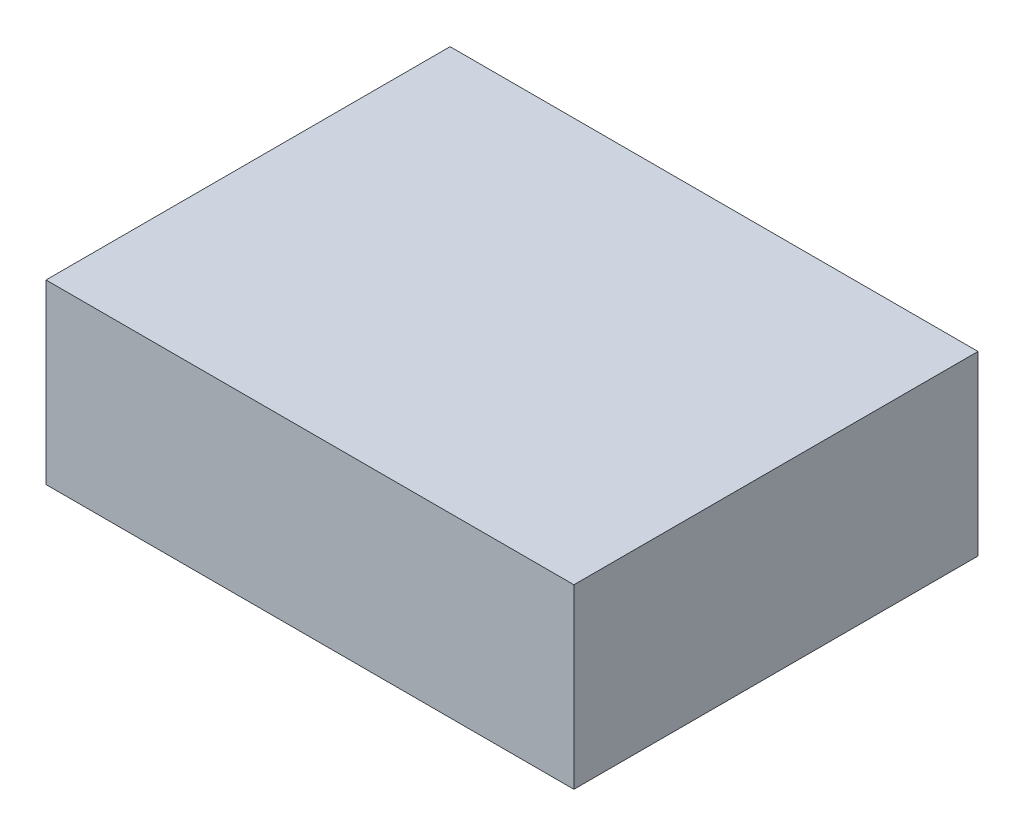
ISO-10303-21;
HEADER;
FILE_DESCRIPTION(('STEP AP214'),'2;1');
FILE_NAME('part.step','',(''),(''),'','','');
FILE_SCHEMA(('AUTOMOTIVE_DESIGN { 1 0 10303 214 1 1 1 1 }'));
ENDSEC;
DATA;
#1=APPLICATION_CONTEXT('core data for automotive mechanical design processes');
#2=APPLICATION_PROTOCOL_DEFINITION('international standard','automotive_design',2000,#1);
#3=PRODUCT_CONTEXT('',#1,'mechanical');
#4=PRODUCT('Part','Part','',(#3));
#5=PRODUCT_RELATED_PRODUCT_CATEGORY('part','',(#4));
#6=PRODUCT_DEFINITION_FORMATION('','',#4);
#7=PRODUCT_DEFINITION_CONTEXT('part definition',#1,'design');
#8=PRODUCT_DEFINITION('design','',#6,#7);
#9=PRODUCT_DEFINITION_SHAPE('','',#8);
#10=(LENGTH_UNIT() NAMED_UNIT(*) SI_UNIT(.MILLI.,.METRE.));
#11=(NAMED_UNIT(*) PLANE_ANGLE_UNIT() SI_UNIT($,.RADIAN.));
#12=(NAMED_UNIT(*) SI_UNIT($,.STERADIAN.) SOLID_ANGLE_UNIT());
#13=UNCERTAINTY_MEASURE_WITH_UNIT(LENGTH_MEASURE(1.E-05),#10,'distance_accuracy_value','');
#14=(GEOMETRIC_REPRESENTATION_CONTEXT(3) GLOBAL_UNCERTAINTY_ASSIGNED_CONTEXT((#13)) GLOBAL_UNIT_ASSIGNED_CONTEXT((#10,
#11,#12)) REPRESENTATION_CONTEXT('',''));
#15=CARTESIAN_POINT('',(0.,0.,0.));
#16=DIRECTION('',(0.,0.,1.));
#17=DIRECTION('',(1.,0.,0.));
#18=AXIS2_PLACEMENT_3D('',#15,#16,#17);
#19=CARTESIAN_POINT('',(1.270000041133E-06,0.,0.22999954));
#20=DIRECTION('',(0.,0.,-1.));
#21=DIRECTION('',(0.,-1.,0.));
#22=AXIS2_PLACEMENT_3D('',#19,#20,#21);
#23=PLANE('',#22);
#24=DIRECTION('',(1.,0.,0.));
#25=VECTOR('',#24,1.);
#26=CARTESIAN_POINT('',(-0.150241,0.05042408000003,0.22999954));
#27=LINE('',#26,#25);
#28=CARTESIAN_POINT('',(-0.150241,0.05042408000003,0.22999954));
#29=VERTEX_POINT('',#28);
#30=CARTESIAN_POINT('',(0.15024354,0.05042408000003,0.22999954));
#31=VERTEX_POINT('',#30);
#32=EDGE_CURVE('E25',#29,#31,#27,.T.);
#33=ORIENTED_EDGE('',*,*,#32,.F.);
#34=DIRECTION('',(0.,1.,0.));
#35=VECTOR('',#34,1.);
#36=CARTESIAN_POINT('',(-0.150241,-0.05042407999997,0.22999954));
#37=LINE('',#36,#35);
#38=CARTESIAN_POINT('',(-0.150241,-0.05042407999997,0.22999954));
#39=VERTEX_POINT('',#38);
#40=EDGE_CURVE('E107',#39,#29,#37,.T.);
#41=ORIENTED_EDGE('',*,*,#40,.F.);
#42=DIRECTION('',(-1.,0.,0.));
#43=VECTOR('',#42,1.);
#44=CARTESIAN_POINT('',(0.15024354,-0.05042407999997,0.22999954));
#45=LINE('',#44,#43);
#46=CARTESIAN_POINT('',(0.15024354,-0.05042407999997,0.22999954));
#47=VERTEX_POINT('',#46);
#48=EDGE_CURVE('E83',#47,#39,#45,.T.);
#49=ORIENTED_EDGE('',*,*,#48,.F.);
#50=DIRECTION('',(0.,-1.,0.));
#51=VECTOR('',#50,1.);
#52=CARTESIAN_POINT('',(0.15024354,0.05042408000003,0.22999954));
#53=LINE('',#52,#51);
#54=EDGE_CURVE('E87',#31,#47,#53,.T.);
#55=ORIENTED_EDGE('',*,*,#54,.F.);
#56=EDGE_LOOP('',(#33,#41,#49,#55));
#57=FACE_BOUND('',#56,.T.);
#58=ADVANCED_FACE('F17',(#57),#23,.F.);
#59=CARTESIAN_POINT('',(1.270000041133E-06,0.,0.));
#60=DIRECTION('',(0.,0.,-1.));
#61=DIRECTION('',(0.,-1.,0.));
#62=AXIS2_PLACEMENT_3D('',#59,#60,#61);
#63=PLANE('',#62);
#64=DIRECTION('',(0.,-1.,0.));
#65=VECTOR('',#64,1.);
#66=CARTESIAN_POINT('',(0.15024354,0.05042408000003,0.));
#67=LINE('',#66,#65);
#68=CARTESIAN_POINT('',(0.15024354,0.05042408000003,0.));
#69=VERTEX_POINT('',#68);
#70=CARTESIAN_POINT('',(0.15024354,-0.05042407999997,0.));
#71=VERTEX_POINT('',#70);
#72=EDGE_CURVE('E71',#69,#71,#67,.T.);
#73=ORIENTED_EDGE('',*,*,#72,.T.);
#74=DIRECTION('',(-1.,0.,0.));
#75=VECTOR('',#74,1.);
#76=CARTESIAN_POINT('',(0.15024354,-0.05042407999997,0.));
#77=LINE('',#76,#75);
#78=CARTESIAN_POINT('',(-0.150241,-0.05042407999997,0.));
#79=VERTEX_POINT('',#78);
#80=EDGE_CURVE('E104',#71,#79,#77,.T.);
#81=ORIENTED_EDGE('',*,*,#80,.T.);
#82=DIRECTION('',(0.,1.,0.));
#83=VECTOR('',#82,1.);
#84=CARTESIAN_POINT('',(-0.150241,-0.05042407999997,0.));
#85=LINE('',#84,#83);
#86=CARTESIAN_POINT('',(-0.150241,0.05042408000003,0.));
#87=VERTEX_POINT('',#86);
#88=EDGE_CURVE('E73',#79,#87,#85,.T.);
#89=ORIENTED_EDGE('',*,*,#88,.T.);
#90=DIRECTION('',(1.,0.,0.));
#91=VECTOR('',#90,1.);
#92=CARTESIAN_POINT('',(-0.150241,0.05042408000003,0.));
#93=LINE('',#92,#91);
#94=EDGE_CURVE('E11',#87,#69,#93,.T.);
#95=ORIENTED_EDGE('',*,*,#94,.T.);
#96=EDGE_LOOP('',(#73,#81,#89,#95));
#97=FACE_BOUND('',#96,.T.);
#98=ADVANCED_FACE('F69',(#97),#63,.T.);
#99=CARTESIAN_POINT('',(-0.150241,0.05042408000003,0.));
#100=DIRECTION('',(0.,1.,0.));
#101=DIRECTION('',(1.,0.,0.));
#102=AXIS2_PLACEMENT_3D('',#99,#100,#101);
#103=PLANE('',#102);
#104=DIRECTION('',(0.,0.,1.));
#105=VECTOR('',#104,1.);
#106=CARTESIAN_POINT('',(-0.150241,0.05042408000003,0.));
#107=LINE('',#106,#105);
#108=EDGE_CURVE('E111',#87,#29,#107,.T.);
#109=ORIENTED_EDGE('',*,*,#108,.T.);
#110=ORIENTED_EDGE('',*,*,#32,.T.);
#111=DIRECTION('',(0.,0.,1.));
#112=VECTOR('',#111,1.);
#113=CARTESIAN_POINT('',(0.15024354,0.05042408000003,0.));
#114=LINE('',#113,#112);
#115=EDGE_CURVE('E79',#69,#31,#114,.T.);
#116=ORIENTED_EDGE('',*,*,#115,.F.);
#117=ORIENTED_EDGE('',*,*,#94,.F.);
#118=EDGE_LOOP('',(#109,#110,#116,#117));
#119=FACE_BOUND('',#118,.T.);
#120=ADVANCED_FACE('F85',(#119),#103,.T.);
#121=CARTESIAN_POINT('',(-0.150241,-0.05042407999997,0.));
#122=DIRECTION('',(-1.,0.,0.));
#123=DIRECTION('',(0.,0.,1.));
#124=AXIS2_PLACEMENT_3D('',#121,#122,#123);
#125=PLANE('',#124);
#126=DIRECTION('',(0.,0.,1.));
#127=VECTOR('',#126,1.);
#128=CARTESIAN_POINT('',(-0.150241,-0.05042407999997,0.));
#129=LINE('',#128,#127);
#130=EDGE_CURVE('E100',#79,#39,#129,.T.);
#131=ORIENTED_EDGE('',*,*,#130,.T.);
#132=ORIENTED_EDGE('',*,*,#40,.T.);
#133=ORIENTED_EDGE('',*,*,#108,.F.);
#134=ORIENTED_EDGE('',*,*,#88,.F.);
#135=EDGE_LOOP('',(#131,#132,#133,#134));
#136=FACE_BOUND('',#135,.T.);
#137=ADVANCED_FACE('F169',(#136),#125,.T.);
#138=CARTESIAN_POINT('',(0.15024354,-0.05042407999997,0.));
#139=DIRECTION('',(0.,-1.,0.));
#140=DIRECTION('',(0.,0.,-1.));
#141=AXIS2_PLACEMENT_3D('',#138,#139,#140);
#142=PLANE('',#141);
#143=DIRECTION('',(0.,0.,1.));
#144=VECTOR('',#143,1.);
#145=CARTESIAN_POINT('',(0.15024354,-0.05042407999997,0.));
#146=LINE('',#145,#144);
#147=EDGE_CURVE('E81',#71,#47,#146,.T.);
#148=ORIENTED_EDGE('',*,*,#147,.T.);
#149=ORIENTED_EDGE('',*,*,#48,.T.);
#150=ORIENTED_EDGE('',*,*,#130,.F.);
#151=ORIENTED_EDGE('',*,*,#80,.F.);
#152=EDGE_LOOP('',(#148,#149,#150,#151));
#153=FACE_BOUND('',#152,.T.);
#154=ADVANCED_FACE('F159',(#153),#142,.T.);
#155=CARTESIAN_POINT('',(0.15024354,0.05042408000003,0.));
#156=DIRECTION('',(1.,0.,0.));
#157=DIRECTION('',(0.,1.,0.));
#158=AXIS2_PLACEMENT_3D('',#155,#156,#157);
#159=PLANE('',#158);
#160=ORIENTED_EDGE('',*,*,#115,.T.);
#161=ORIENTED_EDGE('',*,*,#54,.T.);
#162=ORIENTED_EDGE('',*,*,#147,.F.);
#163=ORIENTED_EDGE('',*,*,#72,.F.);
#164=EDGE_LOOP('',(#160,#161,#162,#163));
#165=FACE_BOUND('',#164,.T.);
#166=ADVANCED_FACE('F77',(#165),#159,.T.);
#167=CLOSED_SHELL('',(#58,#98,#120,#137,#154,#166));
#168=MANIFOLD_SOLID_BREP('B1',#167);
#169=ADVANCED_BREP_SHAPE_REPRESENTATION('',(#18,#168),#14);
#170=SHAPE_DEFINITION_REPRESENTATION(#9,#169);
ENDSEC;
END-ISO-10303-21;
